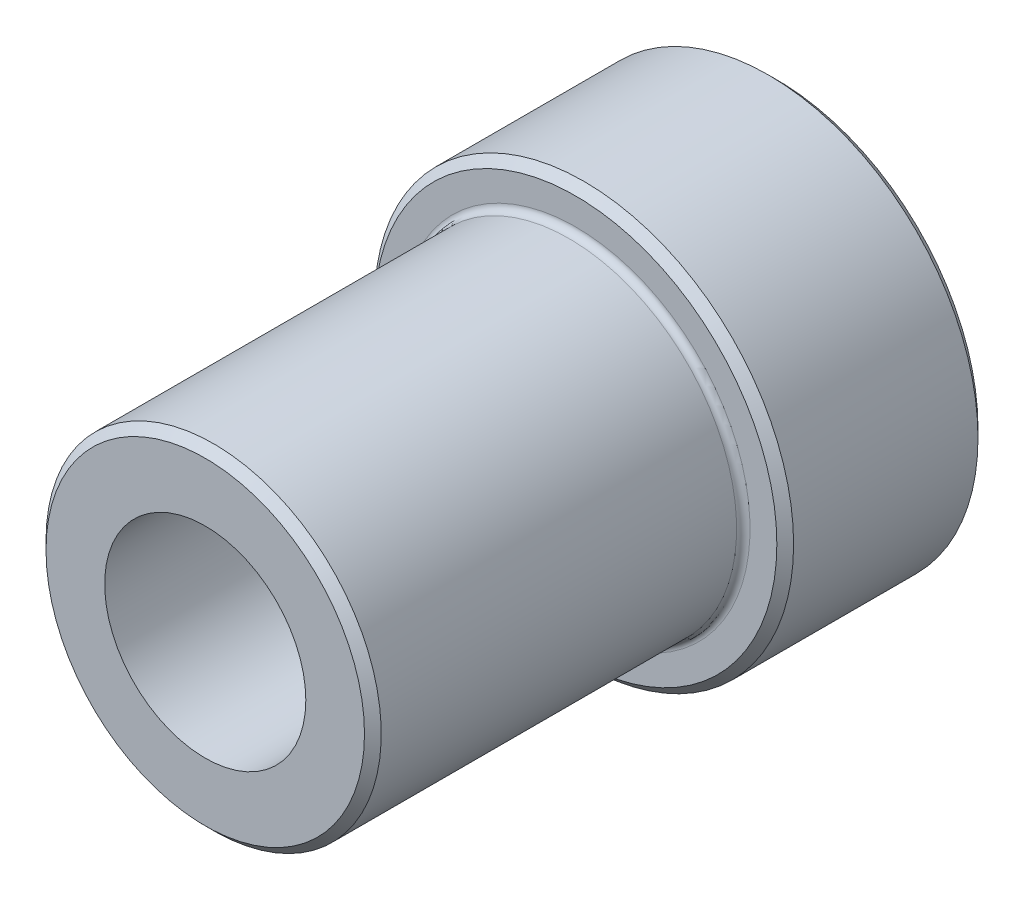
ISO-10303-21;
HEADER;
FILE_DESCRIPTION(('STEP AP214'),'2;1');
FILE_NAME('part.step','',(''),(''),'','','');
FILE_SCHEMA(('AUTOMOTIVE_DESIGN { 1 0 10303 214 1 1 1 1 }'));
ENDSEC;
DATA;
#1=APPLICATION_CONTEXT('core data for automotive mechanical design processes');
#2=APPLICATION_PROTOCOL_DEFINITION('international standard','automotive_design',2000,#1);
#3=PRODUCT_CONTEXT('',#1,'mechanical');
#4=PRODUCT('Part','Part','',(#3));
#5=PRODUCT_RELATED_PRODUCT_CATEGORY('part','',(#4));
#6=PRODUCT_DEFINITION_FORMATION('','',#4);
#7=PRODUCT_DEFINITION_CONTEXT('part definition',#1,'design');
#8=PRODUCT_DEFINITION('design','',#6,#7);
#9=PRODUCT_DEFINITION_SHAPE('','',#8);
#10=(LENGTH_UNIT() NAMED_UNIT(*) SI_UNIT(.MILLI.,.METRE.));
#11=(NAMED_UNIT(*) PLANE_ANGLE_UNIT() SI_UNIT($,.RADIAN.));
#12=(NAMED_UNIT(*) SI_UNIT($,.STERADIAN.) SOLID_ANGLE_UNIT());
#13=UNCERTAINTY_MEASURE_WITH_UNIT(LENGTH_MEASURE(1.E-05),#10,'distance_accuracy_value','');
#14=(GEOMETRIC_REPRESENTATION_CONTEXT(3) GLOBAL_UNCERTAINTY_ASSIGNED_CONTEXT((#13)) GLOBAL_UNIT_ASSIGNED_CONTEXT((#10,
#11,#12)) REPRESENTATION_CONTEXT('',''));
#15=CARTESIAN_POINT('',(0.,0.,0.));
#16=DIRECTION('',(0.,0.,1.));
#17=DIRECTION('',(1.,0.,0.));
#18=AXIS2_PLACEMENT_3D('',#15,#16,#17);
#19=CARTESIAN_POINT('',(0.,0.,0.));
#20=DIRECTION('',(0.,0.,1.));
#21=DIRECTION('',(1.,0.,0.));
#22=AXIS2_PLACEMENT_3D('',#19,#20,#21);
#23=PLANE('',#22);
#24=CARTESIAN_POINT('',(0.,0.,0.));
#25=DIRECTION('',(0.,0.,1.));
#26=DIRECTION('',(1.,0.,0.));
#27=AXIS2_PLACEMENT_3D('',#24,#25,#26);
#28=CIRCLE('',#27,12.);
#29=CARTESIAN_POINT('',(12.,0.,0.));
#30=VERTEX_POINT('',#29);
#31=EDGE_CURVE('E27',#30,#30,#28,.F.);
#32=ORIENTED_EDGE('',*,*,#31,.T.);
#33=EDGE_LOOP('',(#32));
#34=FACE_BOUND('',#33,.T.);
#35=CARTESIAN_POINT('',(0.,0.,0.));
#36=DIRECTION('',(0.,0.,1.));
#37=DIRECTION('',(1.,0.,0.));
#38=AXIS2_PLACEMENT_3D('',#35,#36,#37);
#39=CIRCLE('',#38,6.);
#40=CARTESIAN_POINT('',(6.,0.,0.));
#41=VERTEX_POINT('',#40);
#42=EDGE_CURVE('E44',#41,#41,#39,.T.);
#43=ORIENTED_EDGE('',*,*,#42,.T.);
#44=EDGE_LOOP('',(#43));
#45=FACE_BOUND('',#44,.T.);
#46=ADVANCED_FACE('F12',(#34,#45),#23,.F.);
#47=CARTESIAN_POINT('',(0.,0.,34.1));
#48=DIRECTION('',(0.,0.,1.));
#49=DIRECTION('',(1.,0.,0.));
#50=AXIS2_PLACEMENT_3D('',#47,#48,#49);
#51=CYLINDRICAL_SURFACE('',#50,12.5);
#52=CARTESIAN_POINT('',(0.,0.,0.499999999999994));
#53=DIRECTION('',(0.,0.,1.));
#54=DIRECTION('',(1.,0.,0.));
#55=AXIS2_PLACEMENT_3D('',#52,#53,#54);
#56=CIRCLE('',#55,12.5);
#57=CARTESIAN_POINT('',(12.5,0.,0.499999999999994));
#58=VERTEX_POINT('',#57);
#59=EDGE_CURVE('E32',#58,#58,#56,.T.);
#60=ORIENTED_EDGE('',*,*,#59,.T.);
#61=EDGE_LOOP('',(#60));
#62=FACE_BOUND('',#61,.T.);
#63=CARTESIAN_POINT('',(0.,0.,11.5));
#64=DIRECTION('',(0.,0.,-1.));
#65=DIRECTION('',(-1.,0.,0.));
#66=AXIS2_PLACEMENT_3D('',#63,#64,#65);
#67=CIRCLE('',#66,12.5);
#68=CARTESIAN_POINT('',(-12.5,0.,11.5));
#69=VERTEX_POINT('',#68);
#70=EDGE_CURVE('E35',#69,#69,#67,.T.);
#71=ORIENTED_EDGE('',*,*,#70,.T.);
#72=EDGE_LOOP('',(#71));
#73=FACE_BOUND('',#72,.T.);
#74=ADVANCED_FACE('F71',(#62,#73),#51,.T.);
#75=CARTESIAN_POINT('',(0.,12.5,12.));
#76=DIRECTION('',(0.,0.,-1.));
#77=DIRECTION('',(-1.,0.,0.));
#78=AXIS2_PLACEMENT_3D('',#75,#76,#77);
#79=PLANE('',#78);
#80=CARTESIAN_POINT('',(0.,0.,12.));
#81=DIRECTION('',(0.,0.,-1.));
#82=DIRECTION('',(-1.,0.,0.));
#83=AXIS2_PLACEMENT_3D('',#80,#81,#82);
#84=CIRCLE('',#83,12.);
#85=CARTESIAN_POINT('',(-12.,0.,12.));
#86=VERTEX_POINT('',#85);
#87=EDGE_CURVE('E23',#86,#86,#84,.F.);
#88=ORIENTED_EDGE('',*,*,#87,.T.);
#89=EDGE_LOOP('',(#88));
#90=FACE_BOUND('',#89,.T.);
#91=CARTESIAN_POINT('',(0.,0.,12.));
#92=DIRECTION('',(0.,0.,-1.));
#93=DIRECTION('',(-1.,0.,0.));
#94=AXIS2_PLACEMENT_3D('',#91,#92,#93);
#95=CIRCLE('',#94,10.4);
#96=CARTESIAN_POINT('',(-10.4,0.,12.));
#97=VERTEX_POINT('',#96);
#98=EDGE_CURVE('E38',#97,#97,#95,.T.);
#99=ORIENTED_EDGE('',*,*,#98,.T.);
#100=EDGE_LOOP('',(#99));
#101=FACE_BOUND('',#100,.T.);
#102=ADVANCED_FACE('F68',(#90,#101),#79,.F.);
#103=CARTESIAN_POINT('',(0.,0.,34.1));
#104=DIRECTION('',(0.,0.,1.));
#105=DIRECTION('',(1.,0.,0.));
#106=AXIS2_PLACEMENT_3D('',#103,#104,#105);
#107=CYLINDRICAL_SURFACE('',#106,10.);
#108=CARTESIAN_POINT('',(0.,0.,33.6));
#109=DIRECTION('',(0.,0.,-1.));
#110=DIRECTION('',(-1.,0.,0.));
#111=AXIS2_PLACEMENT_3D('',#108,#109,#110);
#112=CIRCLE('',#111,10.);
#113=CARTESIAN_POINT('',(-10.,0.,33.6));
#114=VERTEX_POINT('',#113);
#115=EDGE_CURVE('E8',#114,#114,#112,.T.);
#116=ORIENTED_EDGE('',*,*,#115,.T.);
#117=EDGE_LOOP('',(#116));
#118=FACE_BOUND('',#117,.T.);
#119=CARTESIAN_POINT('',(0.,0.,12.4));
#120=DIRECTION('',(0.,0.,-1.));
#121=DIRECTION('',(-1.,0.,0.));
#122=AXIS2_PLACEMENT_3D('',#119,#120,#121);
#123=CIRCLE('',#122,10.);
#124=CARTESIAN_POINT('',(-10.,0.,12.4));
#125=VERTEX_POINT('',#124);
#126=EDGE_CURVE('E41',#125,#125,#123,.F.);
#127=ORIENTED_EDGE('',*,*,#126,.T.);
#128=EDGE_LOOP('',(#127));
#129=FACE_BOUND('',#128,.T.);
#130=ADVANCED_FACE('F61',(#118,#129),#107,.T.);
#131=CARTESIAN_POINT('',(0.,10.,34.1));
#132=DIRECTION('',(0.,0.,-1.));
#133=DIRECTION('',(-1.,0.,0.));
#134=AXIS2_PLACEMENT_3D('',#131,#132,#133);
#135=PLANE('',#134);
#136=CARTESIAN_POINT('',(0.,0.,34.1));
#137=DIRECTION('',(0.,0.,-1.));
#138=DIRECTION('',(-1.,0.,0.));
#139=AXIS2_PLACEMENT_3D('',#136,#137,#138);
#140=CIRCLE('',#139,9.5);
#141=CARTESIAN_POINT('',(-9.5,0.,34.1));
#142=VERTEX_POINT('',#141);
#143=EDGE_CURVE('E19',#142,#142,#140,.F.);
#144=ORIENTED_EDGE('',*,*,#143,.T.);
#145=EDGE_LOOP('',(#144));
#146=FACE_BOUND('',#145,.T.);
#147=CARTESIAN_POINT('',(0.,0.,34.1));
#148=DIRECTION('',(0.,0.,1.));
#149=DIRECTION('',(1.,0.,0.));
#150=AXIS2_PLACEMENT_3D('',#147,#148,#149);
#151=CIRCLE('',#150,6.);
#152=CARTESIAN_POINT('',(6.,0.,34.1));
#153=VERTEX_POINT('',#152);
#154=EDGE_CURVE('E45',#153,#153,#151,.T.);
#155=ORIENTED_EDGE('',*,*,#154,.F.);
#156=EDGE_LOOP('',(#155));
#157=FACE_BOUND('',#156,.T.);
#158=ADVANCED_FACE('F56',(#146,#157),#135,.F.);
#159=CARTESIAN_POINT('',(0.,0.,0.));
#160=DIRECTION('',(0.,0.,1.));
#161=DIRECTION('',(1.,0.,0.));
#162=AXIS2_PLACEMENT_3D('',#159,#160,#161);
#163=CYLINDRICAL_SURFACE('',#162,6.);
#164=ORIENTED_EDGE('',*,*,#42,.F.);
#165=EDGE_LOOP('',(#164));
#166=FACE_BOUND('',#165,.T.);
#167=ORIENTED_EDGE('',*,*,#154,.T.);
#168=EDGE_LOOP('',(#167));
#169=FACE_BOUND('',#168,.T.);
#170=ADVANCED_FACE('F52',(#166,#169),#163,.F.);
#171=CARTESIAN_POINT('',(0.,0.,12.4));
#172=DIRECTION('',(0.,0.,-1.));
#173=DIRECTION('',(-1.,0.,0.));
#174=AXIS2_PLACEMENT_3D('',#171,#172,#173);
#175=TOROIDAL_SURFACE('',#174,10.4,0.4);
#176=ORIENTED_EDGE('',*,*,#98,.F.);
#177=EDGE_LOOP('',(#176));
#178=FACE_BOUND('',#177,.T.);
#179=ORIENTED_EDGE('',*,*,#126,.F.);
#180=EDGE_LOOP('',(#179));
#181=FACE_BOUND('',#180,.T.);
#182=ADVANCED_FACE('F55',(#178,#181),#175,.F.);
#183=CARTESIAN_POINT('',(0.,0.,0.499999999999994));
#184=DIRECTION('',(0.,0.,1.));
#185=DIRECTION('',(1.,0.,0.));
#186=AXIS2_PLACEMENT_3D('',#183,#184,#185);
#187=CONICAL_SURFACE('',#186,12.5,0.785398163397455);
#188=ORIENTED_EDGE('',*,*,#31,.F.);
#189=EDGE_LOOP('',(#188));
#190=FACE_BOUND('',#189,.T.);
#191=ORIENTED_EDGE('',*,*,#59,.F.);
#192=EDGE_LOOP('',(#191));
#193=FACE_BOUND('',#192,.T.);
#194=ADVANCED_FACE('F84',(#190,#193),#187,.T.);
#195=CARTESIAN_POINT('',(0.,0.,12.));
#196=DIRECTION('',(0.,0.,-1.));
#197=DIRECTION('',(-1.,0.,0.));
#198=AXIS2_PLACEMENT_3D('',#195,#196,#197);
#199=CONICAL_SURFACE('',#198,12.,0.785398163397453);
#200=ORIENTED_EDGE('',*,*,#70,.F.);
#201=EDGE_LOOP('',(#200));
#202=FACE_BOUND('',#201,.T.);
#203=ORIENTED_EDGE('',*,*,#87,.F.);
#204=EDGE_LOOP('',(#203));
#205=FACE_BOUND('',#204,.T.);
#206=ADVANCED_FACE('F87',(#202,#205),#199,.T.);
#207=CARTESIAN_POINT('',(0.,0.,34.1));
#208=DIRECTION('',(0.,0.,-1.));
#209=DIRECTION('',(-1.,0.,0.));
#210=AXIS2_PLACEMENT_3D('',#207,#208,#209);
#211=CONICAL_SURFACE('',#210,9.5,0.785398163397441);
#212=ORIENTED_EDGE('',*,*,#115,.F.);
#213=EDGE_LOOP('',(#212));
#214=FACE_BOUND('',#213,.T.);
#215=ORIENTED_EDGE('',*,*,#143,.F.);
#216=EDGE_LOOP('',(#215));
#217=FACE_BOUND('',#216,.T.);
#218=ADVANCED_FACE('F14',(#214,#217),#211,.T.);
#219=CLOSED_SHELL('',(#46,#74,#102,#130,#158,#170,#182,#194,#206,#218));
#220=MANIFOLD_SOLID_BREP('B1',#219);
#221=ADVANCED_BREP_SHAPE_REPRESENTATION('',(#18,#220),#14);
#222=SHAPE_DEFINITION_REPRESENTATION(#9,#221);
ENDSEC;
END-ISO-10303-21;
